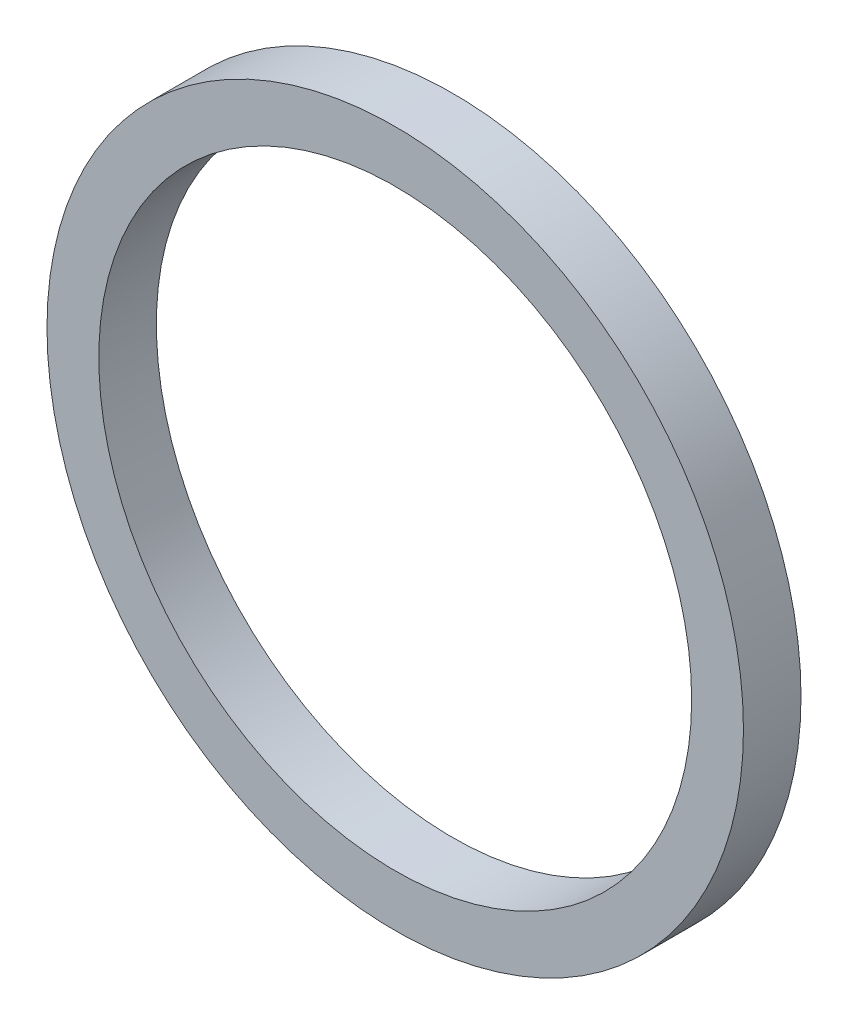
ISO-10303-21;
HEADER;
FILE_DESCRIPTION(('STEP AP214'),'2;1');
FILE_NAME('part.step','',(''),(''),'','','');
FILE_SCHEMA(('AUTOMOTIVE_DESIGN { 1 0 10303 214 1 1 1 1 }'));
ENDSEC;
DATA;
#1=APPLICATION_CONTEXT('core data for automotive mechanical design processes');
#2=APPLICATION_PROTOCOL_DEFINITION('international standard','automotive_design',2000,#1);
#3=PRODUCT_CONTEXT('',#1,'mechanical');
#4=PRODUCT('Part','Part','',(#3));
#5=PRODUCT_RELATED_PRODUCT_CATEGORY('part','',(#4));
#6=PRODUCT_DEFINITION_FORMATION('','',#4);
#7=PRODUCT_DEFINITION_CONTEXT('part definition',#1,'design');
#8=PRODUCT_DEFINITION('design','',#6,#7);
#9=PRODUCT_DEFINITION_SHAPE('','',#8);
#10=(LENGTH_UNIT() NAMED_UNIT(*) SI_UNIT(.MILLI.,.METRE.));
#11=(NAMED_UNIT(*) PLANE_ANGLE_UNIT() SI_UNIT($,.RADIAN.));
#12=(NAMED_UNIT(*) SI_UNIT($,.STERADIAN.) SOLID_ANGLE_UNIT());
#13=UNCERTAINTY_MEASURE_WITH_UNIT(LENGTH_MEASURE(1.E-05),#10,'distance_accuracy_value','');
#14=(GEOMETRIC_REPRESENTATION_CONTEXT(3) GLOBAL_UNCERTAINTY_ASSIGNED_CONTEXT((#13)) GLOBAL_UNIT_ASSIGNED_CONTEXT((#10,
#11,#12)) REPRESENTATION_CONTEXT('',''));
#15=CARTESIAN_POINT('',(0.,0.,0.));
#16=DIRECTION('',(0.,0.,1.));
#17=DIRECTION('',(1.,0.,0.));
#18=AXIS2_PLACEMENT_3D('',#15,#16,#17);
#19=CARTESIAN_POINT('',(-30.6252380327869,42.4041757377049,1.));
#20=DIRECTION('',(0.,0.,-1.));
#21=DIRECTION('',(-1.,0.,0.));
#22=AXIS2_PLACEMENT_3D('',#19,#20,#21);
#23=CYLINDRICAL_SURFACE('',#22,5.15);
#24=CARTESIAN_POINT('',(-30.6252380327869,42.4041757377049,1.));
#25=DIRECTION('',(0.,0.,1.));
#26=DIRECTION('',(1.,0.,0.));
#27=AXIS2_PLACEMENT_3D('',#24,#25,#26);
#28=CIRCLE('',#27,5.15);
#29=CARTESIAN_POINT('',(-25.4752380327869,42.4041757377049,1.));
#30=VERTEX_POINT('',#29);
#31=EDGE_CURVE('E42',#30,#30,#28,.T.);
#32=ORIENTED_EDGE('',*,*,#31,.T.);
#33=EDGE_LOOP('',(#32));
#34=FACE_BOUND('',#33,.T.);
#35=CARTESIAN_POINT('',(-30.6252380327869,42.4041757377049,0.));
#36=DIRECTION('',(0.,0.,1.));
#37=DIRECTION('',(1.,0.,0.));
#38=AXIS2_PLACEMENT_3D('',#35,#36,#37);
#39=CIRCLE('',#38,5.15);
#40=CARTESIAN_POINT('',(-25.4752380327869,42.4041757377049,0.));
#41=VERTEX_POINT('',#40);
#42=EDGE_CURVE('E48',#41,#41,#39,.T.);
#43=ORIENTED_EDGE('',*,*,#42,.F.);
#44=EDGE_LOOP('',(#43));
#45=FACE_BOUND('',#44,.T.);
#46=ADVANCED_FACE('F35',(#34,#45),#23,.F.);
#47=CARTESIAN_POINT('',(-30.6252380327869,42.4041757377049,1.));
#48=DIRECTION('',(0.,0.,-1.));
#49=DIRECTION('',(-1.,0.,0.));
#50=AXIS2_PLACEMENT_3D('',#47,#48,#49);
#51=CYLINDRICAL_SURFACE('',#50,6.05);
#52=CARTESIAN_POINT('',(-30.6252380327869,42.4041757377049,1.));
#53=DIRECTION('',(0.,0.,1.));
#54=DIRECTION('',(1.,0.,0.));
#55=AXIS2_PLACEMENT_3D('',#52,#53,#54);
#56=CIRCLE('',#55,6.05);
#57=CARTESIAN_POINT('',(-24.5752380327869,42.4041757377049,1.));
#58=VERTEX_POINT('',#57);
#59=EDGE_CURVE('E10',#58,#58,#56,.T.);
#60=ORIENTED_EDGE('',*,*,#59,.F.);
#61=EDGE_LOOP('',(#60));
#62=FACE_BOUND('',#61,.T.);
#63=CARTESIAN_POINT('',(-30.6252380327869,42.4041757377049,0.));
#64=DIRECTION('',(0.,0.,1.));
#65=DIRECTION('',(1.,0.,0.));
#66=AXIS2_PLACEMENT_3D('',#63,#64,#65);
#67=CIRCLE('',#66,6.05);
#68=CARTESIAN_POINT('',(-24.5752380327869,42.4041757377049,0.));
#69=VERTEX_POINT('',#68);
#70=EDGE_CURVE('E38',#69,#69,#67,.T.);
#71=ORIENTED_EDGE('',*,*,#70,.T.);
#72=EDGE_LOOP('',(#71));
#73=FACE_BOUND('',#72,.T.);
#74=ADVANCED_FACE('F55',(#62,#73),#51,.T.);
#75=CARTESIAN_POINT('',(0.,0.,1.));
#76=DIRECTION('',(0.,0.,1.));
#77=DIRECTION('',(1.,0.,0.));
#78=AXIS2_PLACEMENT_3D('',#75,#76,#77);
#79=PLANE('',#78);
#80=ORIENTED_EDGE('',*,*,#31,.F.);
#81=EDGE_LOOP('',(#80));
#82=FACE_BOUND('',#81,.T.);
#83=ORIENTED_EDGE('',*,*,#59,.T.);
#84=EDGE_LOOP('',(#83));
#85=FACE_BOUND('',#84,.T.);
#86=ADVANCED_FACE('F59',(#82,#85),#79,.T.);
#87=CARTESIAN_POINT('',(0.,0.,0.));
#88=DIRECTION('',(0.,0.,1.));
#89=DIRECTION('',(1.,0.,0.));
#90=AXIS2_PLACEMENT_3D('',#87,#88,#89);
#91=PLANE('',#90);
#92=ORIENTED_EDGE('',*,*,#42,.T.);
#93=EDGE_LOOP('',(#92));
#94=FACE_BOUND('',#93,.T.);
#95=ORIENTED_EDGE('',*,*,#70,.F.);
#96=EDGE_LOOP('',(#95));
#97=FACE_BOUND('',#96,.T.);
#98=ADVANCED_FACE('F57',(#94,#97),#91,.F.);
#99=CLOSED_SHELL('',(#46,#74,#86,#98));
#100=MANIFOLD_SOLID_BREP('B2',#99);
#101=ADVANCED_BREP_SHAPE_REPRESENTATION('',(#18,#100),#14);
#102=SHAPE_DEFINITION_REPRESENTATION(#9,#101);
ENDSEC;
END-ISO-10303-21;
